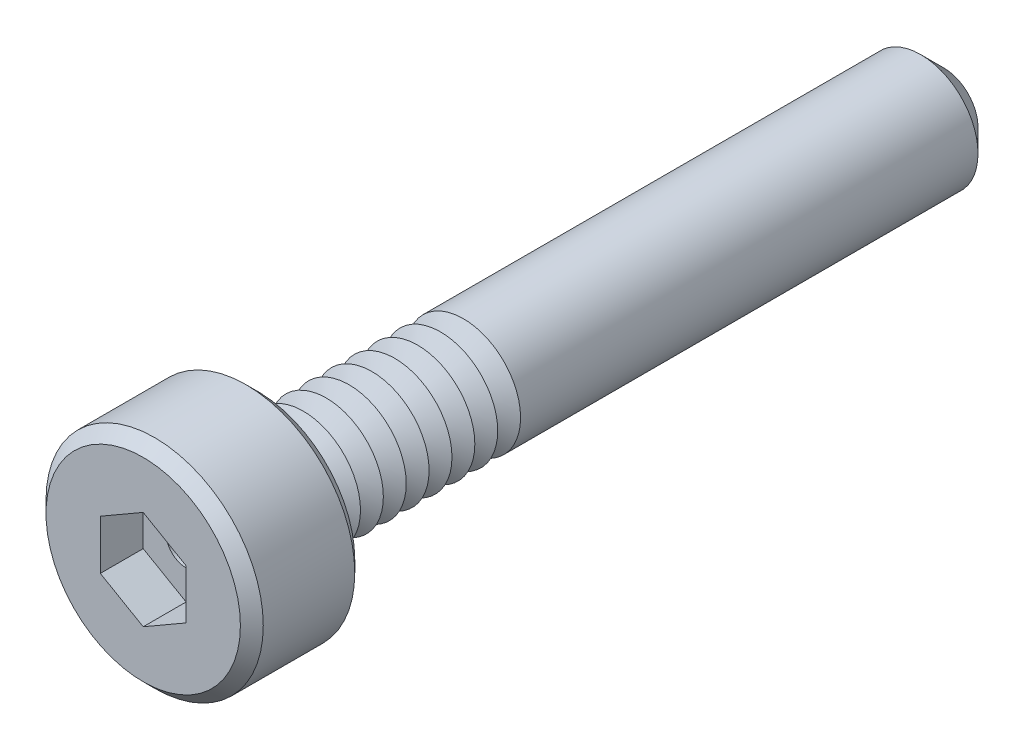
from build123d import *

# Parameters (mm, degrees)
SKETCH1_R           = 1.9
BOSS_EXTRUDE1_DEPTH = 2
SKETCH2_R           = 1
BOSS_EXTRUDE2_DEPTH = 12
CHAMFER1_SIZE       = 0.4
LPATTERN1_COUNT     = 9
LPATTERN1_PITCH     = 0.4
CUT_EXTRUDE1_DEPTH  = 0.75
SKETCH6_R           = 0.35
CUT_EXTRUDE2_DEPTH  = 13.25
CHAMFER2_SIZE       = 0.2


with BuildPart() as part:
    # Sketch1 → Boss-Extrude1 (new body)
    with BuildSketch(Plane.XY):
        Circle(SKETCH1_R)
    extrude(amount=BOSS_EXTRUDE1_DEPTH)

    # Sketch2 → Boss-Extrude2 (add)
    with BuildSketch(Plane(origin=(0, 0, 0), x_dir=(-1, 0, 0), z_dir=(0, 0, -1))):
        Circle(SKETCH2_R)
    extrude(amount=BOSS_EXTRUDE2_DEPTH)

    # Chamfer1
    chamfer1_edges = [part.edges().sort_by_distance(p)[0] for p in [
        (1, 0, -12),
    ]]
    chamfer(chamfer1_edges, length=CHAMFER1_SIZE)

    # Sketch4 → Cut-Revolve1 (revolve, cut)
    with BuildSketch(Plane(origin=(0, 0, 0), x_dir=(0, 0, -1), z_dir=(1, 0, 0)), mode=Mode.PRIVATE) as cut_revolve1_sk:
        Polygon((0, 1), (0.2, 0.653589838), (0.4, 1), align=None)
    cut_revolve1 = revolve(cut_revolve1_sk.sketch.rotate(Axis((0, 0, 2.512122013), (0, 0, -1)), 90), axis=Axis((0, 0, 2.512122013), (0, 0, -1)), mode=Mode.SUBTRACT)

    # LPattern1: Cut-Revolve1 ×9
    with Locations(*[(0, 0, -i * LPATTERN1_PITCH) for i in range(1, LPATTERN1_COUNT)]):
        add(cut_revolve1, mode=Mode.SUBTRACT)

    # Sketch5 → Cut-Extrude1 (cut)
    with BuildSketch(Plane.XY.offset(2)):
        Polygon((0, 0.866025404), (-0.75, 0.433012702), (-0.75, -0.433012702), (0, -0.866025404), (0.75, -0.433012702), (0.75, 0.433012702), align=None)
    extrude(amount=-CUT_EXTRUDE1_DEPTH, mode=Mode.SUBTRACT)

    # Sketch6 → Cut-Extrude2 (cut)
    with BuildSketch(Plane.XY.offset(1.25)):
        Circle(SKETCH6_R)
    extrude(amount=-CUT_EXTRUDE2_DEPTH, mode=Mode.SUBTRACT)

    # Chamfer2
    chamfer2_edges = [part.edges().sort_by_distance(p)[0] for p in [
        (-1.9, 0, 0),
        (-1.9, 0, 2),
    ]]
    chamfer(chamfer2_edges, length=CHAMFER2_SIZE)


solid = part.part
